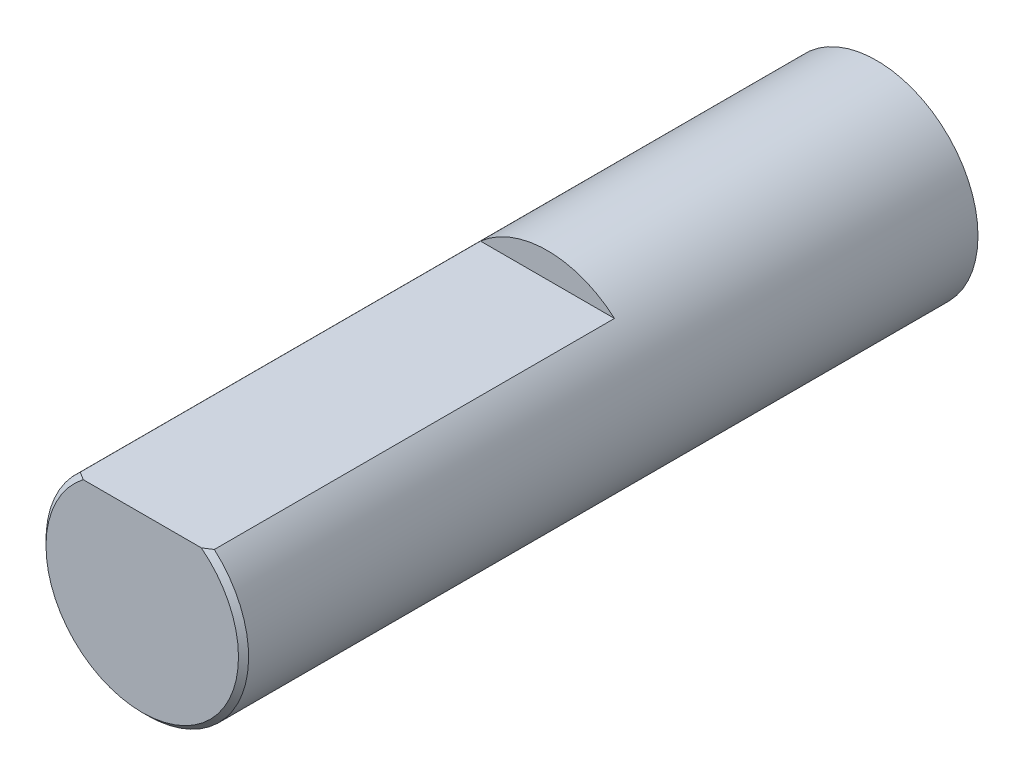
ISO-10303-21;
HEADER;
FILE_DESCRIPTION(('STEP AP214'),'2;1');
FILE_NAME('part.step','',(''),(''),'','','');
FILE_SCHEMA(('AUTOMOTIVE_DESIGN { 1 0 10303 214 1 1 1 1 }'));
ENDSEC;
DATA;
#1=APPLICATION_CONTEXT('core data for automotive mechanical design processes');
#2=APPLICATION_PROTOCOL_DEFINITION('international standard','automotive_design',2000,#1);
#3=PRODUCT_CONTEXT('',#1,'mechanical');
#4=PRODUCT('Part','Part','',(#3));
#5=PRODUCT_RELATED_PRODUCT_CATEGORY('part','',(#4));
#6=PRODUCT_DEFINITION_FORMATION('','',#4);
#7=PRODUCT_DEFINITION_CONTEXT('part definition',#1,'design');
#8=PRODUCT_DEFINITION('design','',#6,#7);
#9=PRODUCT_DEFINITION_SHAPE('','',#8);
#10=(LENGTH_UNIT() NAMED_UNIT(*) SI_UNIT(.MILLI.,.METRE.));
#11=(NAMED_UNIT(*) PLANE_ANGLE_UNIT() SI_UNIT($,.RADIAN.));
#12=(NAMED_UNIT(*) SI_UNIT($,.STERADIAN.) SOLID_ANGLE_UNIT());
#13=UNCERTAINTY_MEASURE_WITH_UNIT(LENGTH_MEASURE(1.E-05),#10,'distance_accuracy_value','');
#14=(GEOMETRIC_REPRESENTATION_CONTEXT(3) GLOBAL_UNCERTAINTY_ASSIGNED_CONTEXT((#13)) GLOBAL_UNIT_ASSIGNED_CONTEXT((#10,
#11,#12)) REPRESENTATION_CONTEXT('',''));
#15=CARTESIAN_POINT('',(0.,0.,0.));
#16=DIRECTION('',(0.,0.,1.));
#17=DIRECTION('',(1.,0.,0.));
#18=AXIS2_PLACEMENT_3D('',#15,#16,#17);
#19=CARTESIAN_POINT('',(0.,0.,14.5));
#20=DIRECTION('',(0.,0.,-1.));
#21=DIRECTION('',(-1.,0.,0.));
#22=AXIS2_PLACEMENT_3D('',#19,#20,#21);
#23=CYLINDRICAL_SURFACE('',#22,2.);
#24=DIRECTION('',(0.,0.,1.));
#25=VECTOR('',#24,1.);
#26=CARTESIAN_POINT('',(1.3228756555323,1.5,6.5));
#27=LINE('',#26,#25);
#28=CARTESIAN_POINT('',(1.3228756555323,1.5,6.5));
#29=VERTEX_POINT('',#28);
#30=CARTESIAN_POINT('',(1.3228756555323,1.5,14.4));
#31=VERTEX_POINT('',#30);
#32=EDGE_CURVE('E76',#29,#31,#27,.T.);
#33=ORIENTED_EDGE('',*,*,#32,.T.);
#34=CARTESIAN_POINT('',(0.,0.,14.4));
#35=DIRECTION('',(0.,0.,1.));
#36=DIRECTION('',(1.,0.,0.));
#37=AXIS2_PLACEMENT_3D('',#34,#35,#36);
#38=CIRCLE('',#37,2.);
#39=CARTESIAN_POINT('',(-1.3228756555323,1.5,14.4));
#40=VERTEX_POINT('',#39);
#41=EDGE_CURVE('E11',#31,#40,#38,.F.);
#42=ORIENTED_EDGE('',*,*,#41,.T.);
#43=DIRECTION('',(0.,0.,1.));
#44=VECTOR('',#43,1.);
#45=CARTESIAN_POINT('',(-1.3228756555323,1.5,6.5));
#46=LINE('',#45,#44);
#47=CARTESIAN_POINT('',(-1.3228756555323,1.5,6.5));
#48=VERTEX_POINT('',#47);
#49=EDGE_CURVE('E74',#48,#40,#46,.T.);
#50=ORIENTED_EDGE('',*,*,#49,.F.);
#51=CARTESIAN_POINT('',(0.,0.,6.5));
#52=DIRECTION('',(0.,0.,1.));
#53=DIRECTION('',(1.,0.,0.));
#54=AXIS2_PLACEMENT_3D('',#51,#52,#53);
#55=CIRCLE('',#54,2.);
#56=EDGE_CURVE('E67',#29,#48,#55,.T.);
#57=ORIENTED_EDGE('',*,*,#56,.F.);
#58=EDGE_LOOP('',(#33,#42,#50,#57));
#59=FACE_BOUND('',#58,.T.);
#60=CARTESIAN_POINT('',(0.,0.,0.));
#61=DIRECTION('',(0.,0.,1.));
#62=DIRECTION('',(1.,0.,0.));
#63=AXIS2_PLACEMENT_3D('',#60,#61,#62);
#64=CIRCLE('',#63,2.);
#65=CARTESIAN_POINT('',(2.,0.,0.));
#66=VERTEX_POINT('',#65);
#67=EDGE_CURVE('E80',#66,#66,#64,.T.);
#68=ORIENTED_EDGE('',*,*,#67,.T.);
#69=EDGE_LOOP('',(#68));
#70=FACE_BOUND('',#69,.T.);
#71=ADVANCED_FACE('F33',(#59,#70),#23,.T.);
#72=CARTESIAN_POINT('',(0.,0.,14.5));
#73=DIRECTION('',(0.,0.,1.));
#74=DIRECTION('',(1.,0.,0.));
#75=AXIS2_PLACEMENT_3D('',#72,#73,#74);
#76=PLANE('',#75);
#77=DIRECTION('',(1.,0.,0.));
#78=VECTOR('',#77,1.);
#79=CARTESIAN_POINT('',(-1.3228756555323,1.5,14.5));
#80=LINE('',#79,#78);
#81=CARTESIAN_POINT('',(-1.16619037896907,1.5,14.5));
#82=VERTEX_POINT('',#81);
#83=CARTESIAN_POINT('',(1.16619037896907,1.5,14.5));
#84=VERTEX_POINT('',#83);
#85=EDGE_CURVE('E71',#82,#84,#80,.T.);
#86=ORIENTED_EDGE('',*,*,#85,.F.);
#87=CARTESIAN_POINT('',(0.,0.,14.5));
#88=DIRECTION('',(0.,0.,1.));
#89=DIRECTION('',(1.,0.,0.));
#90=AXIS2_PLACEMENT_3D('',#87,#88,#89);
#91=CIRCLE('',#90,1.90000000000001);
#92=EDGE_CURVE('E86',#82,#84,#91,.T.);
#93=ORIENTED_EDGE('',*,*,#92,.T.);
#94=EDGE_LOOP('',(#86,#93));
#95=FACE_BOUND('',#94,.T.);
#96=ADVANCED_FACE('F102',(#95),#76,.T.);
#97=CARTESIAN_POINT('',(0.,0.,0.));
#98=DIRECTION('',(0.,0.,1.));
#99=DIRECTION('',(1.,0.,0.));
#100=AXIS2_PLACEMENT_3D('',#97,#98,#99);
#101=PLANE('',#100);
#102=ORIENTED_EDGE('',*,*,#67,.F.);
#103=EDGE_LOOP('',(#102));
#104=FACE_BOUND('',#103,.T.);
#105=ADVANCED_FACE('F101',(#104),#101,.F.);
#106=CARTESIAN_POINT('',(-1.3228756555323,1.5,6.5));
#107=DIRECTION('',(0.,-1.,0.));
#108=DIRECTION('',(0.,0.,-1.));
#109=AXIS2_PLACEMENT_3D('',#106,#107,#108);
#110=PLANE('',#109);
#111=ORIENTED_EDGE('',*,*,#85,.T.);
#112=CARTESIAN_POINT('',(1.16619037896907,1.5,14.5));
#113=CARTESIAN_POINT('',(1.19258664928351,1.5,14.483775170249));
#114=CARTESIAN_POINT('',(1.2188419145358,1.5,14.4673294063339));
#115=CARTESIAN_POINT('',(1.2710703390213,1.5,14.433996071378));
#116=CARTESIAN_POINT('',(1.29704349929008,1.5,14.4171085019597));
#117=CARTESIAN_POINT('',(1.3228756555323,1.5,14.4));
#118=B_SPLINE_CURVE_WITH_KNOTS('',3,(#112,#113,#114,#115,#116,#117),.UNSPECIFIED.,.F.,.F.,(4,2,
4),(0.,0.0929420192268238,0.185883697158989),.UNSPECIFIED.);
#119=EDGE_CURVE('E42',#84,#31,#118,.T.);
#120=ORIENTED_EDGE('',*,*,#119,.T.);
#121=ORIENTED_EDGE('',*,*,#32,.F.);
#122=DIRECTION('',(1.,0.,0.));
#123=VECTOR('',#122,1.);
#124=CARTESIAN_POINT('',(-1.3228756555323,1.5,6.5));
#125=LINE('',#124,#123);
#126=EDGE_CURVE('E70',#48,#29,#125,.T.);
#127=ORIENTED_EDGE('',*,*,#126,.F.);
#128=ORIENTED_EDGE('',*,*,#49,.T.);
#129=CARTESIAN_POINT('',(-1.3228756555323,1.5,14.4));
#130=CARTESIAN_POINT('',(-1.29704349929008,1.5,14.4171085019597));
#131=CARTESIAN_POINT('',(-1.2710703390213,1.5,14.433996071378));
#132=CARTESIAN_POINT('',(-1.2188419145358,1.5,14.4673294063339));
#133=CARTESIAN_POINT('',(-1.19258664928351,1.5,14.483775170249));
#134=CARTESIAN_POINT('',(-1.16619037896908,1.5,14.5));
#135=B_SPLINE_CURVE_WITH_KNOTS('',3,(#129,#130,#131,#132,#133,#134),.UNSPECIFIED.,.F.,.F.,(4,2,
4),(0.,0.0929416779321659,0.185883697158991),.UNSPECIFIED.);
#136=EDGE_CURVE('E89',#40,#82,#135,.T.);
#137=ORIENTED_EDGE('',*,*,#136,.T.);
#138=EDGE_LOOP('',(#111,#120,#121,#127,#128,#137));
#139=FACE_BOUND('',#138,.T.);
#140=ADVANCED_FACE('F73',(#139),#110,.F.);
#141=CARTESIAN_POINT('',(0.,0.,6.5));
#142=DIRECTION('',(0.,0.,1.));
#143=DIRECTION('',(1.,0.,0.));
#144=AXIS2_PLACEMENT_3D('',#141,#142,#143);
#145=PLANE('',#144);
#146=ORIENTED_EDGE('',*,*,#56,.T.);
#147=ORIENTED_EDGE('',*,*,#126,.T.);
#148=EDGE_LOOP('',(#146,#147));
#149=FACE_BOUND('',#148,.T.);
#150=ADVANCED_FACE('F69',(#149),#145,.T.);
#151=CARTESIAN_POINT('',(0.,0.,14.5));
#152=DIRECTION('',(0.,0.,-1.));
#153=DIRECTION('',(-1.,0.,0.));
#154=AXIS2_PLACEMENT_3D('',#151,#152,#153);
#155=CONICAL_SURFACE('',#154,1.90000000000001,0.785398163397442);
#156=ORIENTED_EDGE('',*,*,#136,.F.);
#157=ORIENTED_EDGE('',*,*,#41,.F.);
#158=ORIENTED_EDGE('',*,*,#119,.F.);
#159=ORIENTED_EDGE('',*,*,#92,.F.);
#160=EDGE_LOOP('',(#156,#157,#158,#159));
#161=FACE_BOUND('',#160,.T.);
#162=ADVANCED_FACE('F35',(#161),#155,.T.);
#163=CLOSED_SHELL('',(#71,#96,#105,#140,#150,#162));
#164=MANIFOLD_SOLID_BREP('B2',#163);
#165=ADVANCED_BREP_SHAPE_REPRESENTATION('',(#18,#164),#14);
#166=SHAPE_DEFINITION_REPRESENTATION(#9,#165);
ENDSEC;
END-ISO-10303-21;
